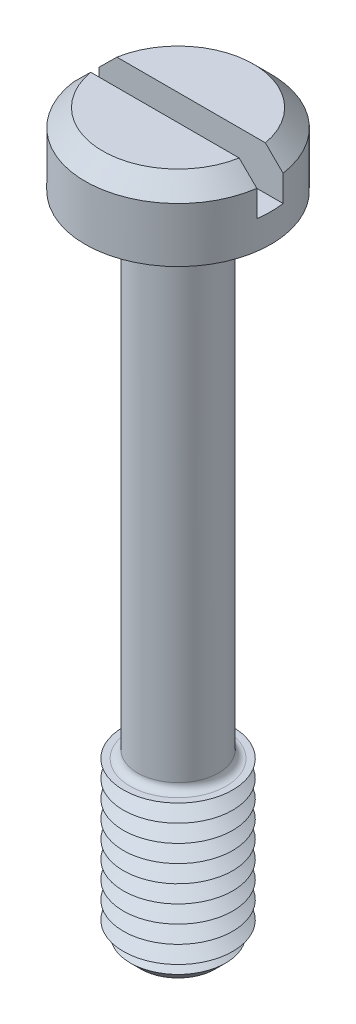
from build123d import *

# Parameters (mm, degrees)
SKETCH1_R           = 4.25
BOSS_EXTRUDE1_DEPTH = 3.3
SKETCH2_R           = 1.85
BOSS_EXTRUDE2_DEPTH = 30
SKETCH3_R           = 2.5
BOSS_EXTRUDE3_DEPTH = 7.5
CHAMFER1_SIZE       = 0.8
LPATTERN1_COUNT     = 9
LPATTERN1_PITCH     = 0.8
FILLET1_R           = 0.35
CHAMFER2_SIZE       = 0.8
SKETCH6_W           = 8.5
SKETCH6_H           = 1.2
CUT_EXTRUDE1_DEPTH  = 2


with BuildPart() as part:
    # Sketch1 → Boss-Extrude1 (new body)
    with BuildSketch(Plane(origin=(0, 0, 0), x_dir=(1, 0, 0), z_dir=(0, 1, 0))):
        with Locations(Location((0, 0, 0), (0, 0, 270))):
            Circle(SKETCH1_R)
    extrude(amount=BOSS_EXTRUDE1_DEPTH)

    # Sketch2 → Boss-Extrude2 (add)
    with BuildSketch(Plane.XZ):
        with Locations(Location((0, 0, 0), (0, 0, 270))):
            Circle(SKETCH2_R)
    extrude(amount=BOSS_EXTRUDE2_DEPTH)

    # Sketch3 → Boss-Extrude3 (add)
    with BuildSketch(Plane.XZ.offset(30)):
        with Locations(Location((0, 0, 0), (0, 0, 270))):
            Circle(SKETCH3_R)
    extrude(amount=-BOSS_EXTRUDE3_DEPTH)

    # Chamfer1
    chamfer1_edges = [part.edges().sort_by_distance(p)[0] for p in [
        (0, -30, 2.5),
    ]]
    chamfer(chamfer1_edges, length=CHAMFER1_SIZE)

    # Sketch5 → Cut-Revolve1 (revolve, cut)
    with BuildSketch(Plane(origin=(0, 0, 0), x_dir=(0, 0, -1), z_dir=(1, 0, 0))):
        Polygon((-2.5, -22.5), (-1.807179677, -22.9), (-2.5, -23.3), align=None)
    cut_revolve1 = revolve(axis=Axis((0, -6.58711856, 0), (0, -1, 0)), mode=Mode.SUBTRACT)

    # LPattern1: Cut-Revolve1 ×9
    with Locations(*[(0, -i * LPATTERN1_PITCH, 0) for i in range(1, LPATTERN1_COUNT)]):
        add(cut_revolve1, mode=Mode.SUBTRACT)

    # Fillet1
    fillet1_edges = [part.edges().sort_by_distance(p)[0] for p in [
        (0, 0, 1.85),
        (0, -22.5, 1.85),
    ]]
    fillet(fillet1_edges, radius=FILLET1_R)

    # Chamfer2
    chamfer2_edges = [part.edges().sort_by_distance(p)[0] for p in [
        (0, 3.3, -4.25),
    ]]
    chamfer(chamfer2_edges, length=CHAMFER2_SIZE)

    # Sketch6 → Cut-Extrude1 (cut)
    with BuildSketch(Plane(origin=(0, 3.3, 0), x_dir=(1, 0, 0), z_dir=(0, 1, 0))):
        Rectangle(SKETCH6_W, SKETCH6_H)
    extrude(amount=-CUT_EXTRUDE1_DEPTH, mode=Mode.SUBTRACT)


solid = part.part
